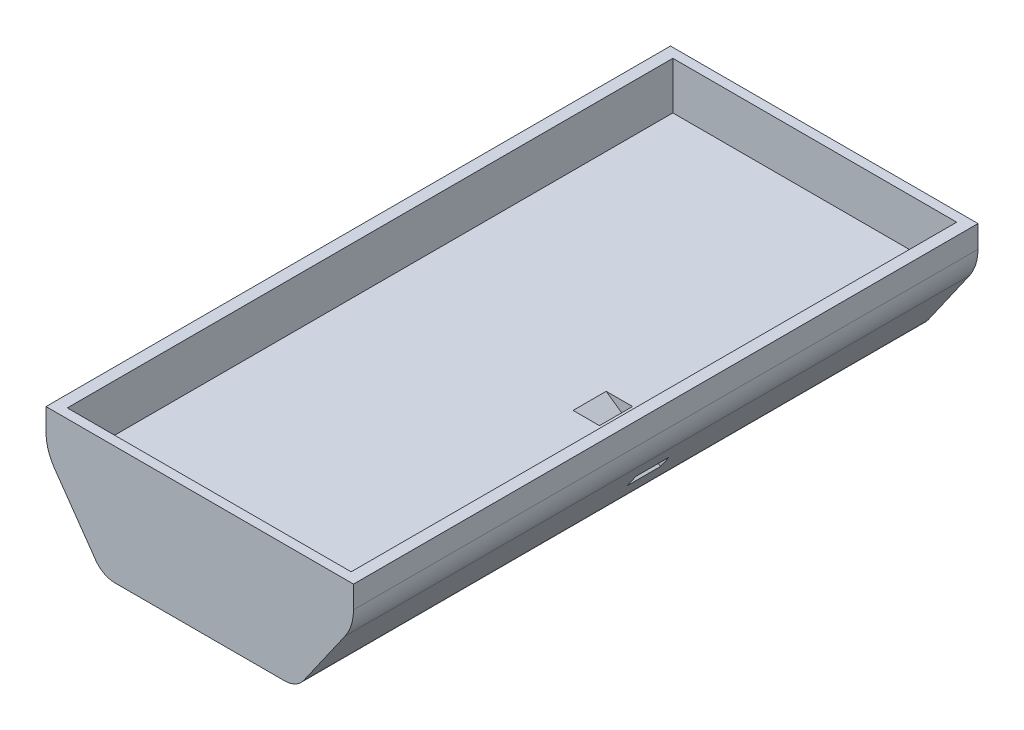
ISO-10303-21;
HEADER;
FILE_DESCRIPTION(('STEP AP214'),'2;1');
FILE_NAME('part.step','',(''),(''),'','','');
FILE_SCHEMA(('AUTOMOTIVE_DESIGN { 1 0 10303 214 1 1 1 1 }'));
ENDSEC;
DATA;
#1=APPLICATION_CONTEXT('core data for automotive mechanical design processes');
#2=APPLICATION_PROTOCOL_DEFINITION('international standard','automotive_design',2000,#1);
#3=PRODUCT_CONTEXT('',#1,'mechanical');
#4=PRODUCT('Part','Part','',(#3));
#5=PRODUCT_RELATED_PRODUCT_CATEGORY('part','',(#4));
#6=PRODUCT_DEFINITION_FORMATION('','',#4);
#7=PRODUCT_DEFINITION_CONTEXT('part definition',#1,'design');
#8=PRODUCT_DEFINITION('design','',#6,#7);
#9=PRODUCT_DEFINITION_SHAPE('','',#8);
#10=(LENGTH_UNIT() NAMED_UNIT(*) SI_UNIT(.MILLI.,.METRE.));
#11=(NAMED_UNIT(*) PLANE_ANGLE_UNIT() SI_UNIT($,.RADIAN.));
#12=(NAMED_UNIT(*) SI_UNIT($,.STERADIAN.) SOLID_ANGLE_UNIT());
#13=UNCERTAINTY_MEASURE_WITH_UNIT(LENGTH_MEASURE(1.E-05),#10,'distance_accuracy_value','');
#14=(GEOMETRIC_REPRESENTATION_CONTEXT(3) GLOBAL_UNCERTAINTY_ASSIGNED_CONTEXT((#13)) GLOBAL_UNIT_ASSIGNED_CONTEXT((#10,
#11,#12)) REPRESENTATION_CONTEXT('',''));
#15=CARTESIAN_POINT('',(0.,0.,0.));
#16=DIRECTION('',(0.,0.,1.));
#17=DIRECTION('',(1.,0.,0.));
#18=AXIS2_PLACEMENT_3D('',#15,#16,#17);
#19=CARTESIAN_POINT('',(43.3318614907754,21.0614031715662,67.));
#20=DIRECTION('',(0.,0.,1.));
#21=DIRECTION('',(1.,0.,0.));
#22=AXIS2_PLACEMENT_3D('',#19,#20,#21);
#23=PLANE('',#22);
#24=DIRECTION('',(-1.,0.,0.));
#25=VECTOR('',#24,1.);
#26=CARTESIAN_POINT('',(43.3318614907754,15.,67.));
#27=LINE('',#26,#25);
#28=CARTESIAN_POINT('',(51.9884423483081,15.,67.));
#29=VERTEX_POINT('',#28);
#30=CARTESIAN_POINT('',(46.4094126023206,15.,67.));
#31=VERTEX_POINT('',#30);
#32=EDGE_CURVE('E59',#29,#31,#27,.T.);
#33=ORIENTED_EDGE('',*,*,#32,.F.);
#34=DIRECTION('',(0.819152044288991,-0.573576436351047,0.));
#35=VECTOR('',#34,1.);
#36=CARTESIAN_POINT('',(43.3318614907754,21.0614031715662,67.));
#37=LINE('',#36,#35);
#38=CARTESIAN_POINT('',(59.7149023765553,9.58987444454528,67.));
#39=VERTEX_POINT('',#38);
#40=EDGE_CURVE('E217',#29,#39,#37,.T.);
#41=ORIENTED_EDGE('',*,*,#40,.T.);
#42=DIRECTION('',(-0.573576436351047,-0.819152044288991,0.));
#43=VECTOR('',#42,1.);
#44=CARTESIAN_POINT('',(59.7149023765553,9.58987444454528,67.));
#45=LINE('',#44,#43);
#46=CARTESIAN_POINT('',(57.8794577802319,6.96858790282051,67.));
#47=VERTEX_POINT('',#46);
#48=EDGE_CURVE('E204',#39,#47,#45,.T.);
#49=ORIENTED_EDGE('',*,*,#48,.T.);
#50=DIRECTION('',(0.819152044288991,-0.573576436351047,0.));
#51=VECTOR('',#50,1.);
#52=CARTESIAN_POINT('',(41.4964168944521,18.4401166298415,67.));
#53=LINE('',#52,#51);
#54=EDGE_CURVE('E216',#31,#47,#53,.T.);
#55=ORIENTED_EDGE('',*,*,#54,.F.);
#56=EDGE_LOOP('',(#33,#41,#49,#55));
#57=FACE_BOUND('',#56,.T.);
#58=ADVANCED_FACE('F37',(#57),#23,.F.);
#59=CARTESIAN_POINT('',(43.3318614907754,21.0614031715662,67.));
#60=DIRECTION('',(0.573576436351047,0.819152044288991,0.));
#61=DIRECTION('',(-0.819152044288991,0.573576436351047,0.));
#62=AXIS2_PLACEMENT_3D('',#59,#60,#61);
#63=PLANE('',#62);
#64=DIRECTION('',(0.,0.,1.));
#65=VECTOR('',#64,1.);
#66=CARTESIAN_POINT('',(51.9884423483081,15.,67.));
#67=LINE('',#66,#65);
#68=CARTESIAN_POINT('',(51.9884423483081,15.,60.));
#69=VERTEX_POINT('',#68);
#70=EDGE_CURVE('E201',#69,#29,#67,.T.);
#71=ORIENTED_EDGE('',*,*,#70,.F.);
#72=DIRECTION('',(0.819152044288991,-0.573576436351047,0.));
#73=VECTOR('',#72,1.);
#74=CARTESIAN_POINT('',(43.3318614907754,21.0614031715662,60.));
#75=LINE('',#74,#73);
#76=CARTESIAN_POINT('',(59.7149023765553,9.58987444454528,60.));
#77=VERTEX_POINT('',#76);
#78=EDGE_CURVE('E220',#69,#77,#75,.T.);
#79=ORIENTED_EDGE('',*,*,#78,.T.);
#80=DIRECTION('',(0.,0.,1.));
#81=VECTOR('',#80,1.);
#82=CARTESIAN_POINT('',(59.7149023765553,9.58987444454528,67.));
#83=LINE('',#82,#81);
#84=EDGE_CURVE('E213',#77,#39,#83,.T.);
#85=ORIENTED_EDGE('',*,*,#84,.T.);
#86=ORIENTED_EDGE('',*,*,#40,.F.);
#87=EDGE_LOOP('',(#71,#79,#85,#86));
#88=FACE_BOUND('',#87,.T.);
#89=ADVANCED_FACE('F361',(#88),#63,.F.);
#90=CARTESIAN_POINT('',(43.3318614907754,21.0614031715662,60.));
#91=DIRECTION('',(0.,0.,-1.));
#92=DIRECTION('',(0.,1.,0.));
#93=AXIS2_PLACEMENT_3D('',#90,#91,#92);
#94=PLANE('',#93);
#95=DIRECTION('',(1.,0.,0.));
#96=VECTOR('',#95,1.);
#97=CARTESIAN_POINT('',(43.3318614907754,15.,60.));
#98=LINE('',#97,#96);
#99=CARTESIAN_POINT('',(46.4094126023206,15.,60.));
#100=VERTEX_POINT('',#99);
#101=EDGE_CURVE('E196',#100,#69,#98,.T.);
#102=ORIENTED_EDGE('',*,*,#101,.F.);
#103=DIRECTION('',(0.819152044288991,-0.573576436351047,0.));
#104=VECTOR('',#103,1.);
#105=CARTESIAN_POINT('',(41.4964168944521,18.4401166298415,60.));
#106=LINE('',#105,#104);
#107=CARTESIAN_POINT('',(57.8794577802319,6.96858790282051,60.));
#108=VERTEX_POINT('',#107);
#109=EDGE_CURVE('E222',#100,#108,#106,.T.);
#110=ORIENTED_EDGE('',*,*,#109,.T.);
#111=DIRECTION('',(0.573576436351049,0.81915204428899,0.));
#112=VECTOR('',#111,1.);
#113=CARTESIAN_POINT('',(59.7149023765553,9.58987444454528,60.));
#114=LINE('',#113,#112);
#115=EDGE_CURVE('E210',#108,#77,#114,.T.);
#116=ORIENTED_EDGE('',*,*,#115,.T.);
#117=ORIENTED_EDGE('',*,*,#78,.F.);
#118=EDGE_LOOP('',(#102,#110,#116,#117));
#119=FACE_BOUND('',#118,.T.);
#120=ADVANCED_FACE('F368',(#119),#94,.F.);
#121=CARTESIAN_POINT('',(41.4964168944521,18.4401166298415,67.));
#122=DIRECTION('',(-0.573576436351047,-0.819152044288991,0.));
#123=DIRECTION('',(0.819152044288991,-0.573576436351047,0.));
#124=AXIS2_PLACEMENT_3D('',#121,#122,#123);
#125=PLANE('',#124);
#126=DIRECTION('',(0.,0.,-1.));
#127=VECTOR('',#126,1.);
#128=CARTESIAN_POINT('',(46.4094126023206,15.,67.));
#129=LINE('',#128,#127);
#130=EDGE_CURVE('E11',#31,#100,#129,.T.);
#131=ORIENTED_EDGE('',*,*,#130,.F.);
#132=ORIENTED_EDGE('',*,*,#54,.T.);
#133=DIRECTION('',(0.,0.,-1.));
#134=VECTOR('',#133,1.);
#135=CARTESIAN_POINT('',(57.8794577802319,6.96858790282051,67.));
#136=LINE('',#135,#134);
#137=EDGE_CURVE('E207',#47,#108,#136,.T.);
#138=ORIENTED_EDGE('',*,*,#137,.T.);
#139=ORIENTED_EDGE('',*,*,#109,.F.);
#140=EDGE_LOOP('',(#131,#132,#138,#139));
#141=FACE_BOUND('',#140,.T.);
#142=ADVANCED_FACE('F373',(#141),#125,.F.);
#143=CARTESIAN_POINT('',(0.,0.,132.));
#144=DIRECTION('',(0.,0.,-1.));
#145=DIRECTION('',(-1.,0.,0.));
#146=AXIS2_PLACEMENT_3D('',#143,#144,#145);
#147=PLANE('',#146);
#148=DIRECTION('',(1.,0.,0.));
#149=VECTOR('',#148,1.);
#150=CARTESIAN_POINT('',(0.,25.,132.));
#151=LINE('',#150,#149);
#152=CARTESIAN_POINT('',(0.,25.,132.));
#153=VERTEX_POINT('',#152);
#154=CARTESIAN_POINT('',(65.,25.,132.));
#155=VERTEX_POINT('',#154);
#156=EDGE_CURVE('E230',#153,#155,#151,.T.);
#157=ORIENTED_EDGE('',*,*,#156,.F.);
#158=DIRECTION('',(0.,-1.,0.));
#159=VECTOR('',#158,1.);
#160=CARTESIAN_POINT('',(0.,0.,132.));
#161=LINE('',#160,#159);
#162=CARTESIAN_POINT('',(0.,20.2907639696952,132.));
#163=VERTEX_POINT('',#162);
#164=EDGE_CURVE('E235',#153,#163,#161,.T.);
#165=ORIENTED_EDGE('',*,*,#164,.T.);
#166=CARTESIAN_POINT('',(9.99999999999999,20.2907639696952,132.));
#167=DIRECTION('',(0.,0.,-1.));
#168=DIRECTION('',(-1.,0.,0.));
#169=AXIS2_PLACEMENT_3D('',#166,#167,#168);
#170=CIRCLE('',#169,10.);
#171=CARTESIAN_POINT('',(1.80847955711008,14.5549996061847,132.));
#172=VERTEX_POINT('',#171);
#173=EDGE_CURVE('E273',#163,#172,#170,.F.);
#174=ORIENTED_EDGE('',*,*,#173,.T.);
#175=DIRECTION('',(-0.573576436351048,0.819152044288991,0.));
#176=VECTOR('',#175,1.);
#177=CARTESIAN_POINT('',(12.,0.,132.));
#178=LINE('',#177,#176);
#179=CARTESIAN_POINT('',(10.5070750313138,2.13211781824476,132.));
#180=VERTEX_POINT('',#179);
#181=EDGE_CURVE('E267',#172,#180,#178,.F.);
#182=ORIENTED_EDGE('',*,*,#181,.T.);
#183=CARTESIAN_POINT('',(14.6028352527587,5.,132.));
#184=DIRECTION('',(0.,0.,-1.));
#185=DIRECTION('',(-1.,0.,0.));
#186=AXIS2_PLACEMENT_3D('',#183,#184,#185);
#187=CIRCLE('',#186,5.);
#188=CARTESIAN_POINT('',(14.6028352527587,0.,132.));
#189=VERTEX_POINT('',#188);
#190=EDGE_CURVE('E301',#180,#189,#187,.F.);
#191=ORIENTED_EDGE('',*,*,#190,.T.);
#192=DIRECTION('',(1.,0.,0.));
#193=VECTOR('',#192,1.);
#194=CARTESIAN_POINT('',(0.,0.,132.));
#195=LINE('',#194,#193);
#196=CARTESIAN_POINT('',(50.3971647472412,0.,132.));
#197=VERTEX_POINT('',#196);
#198=EDGE_CURVE('E237',#189,#197,#195,.T.);
#199=ORIENTED_EDGE('',*,*,#198,.T.);
#200=CARTESIAN_POINT('',(50.3971647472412,5.,132.));
#201=DIRECTION('',(0.,0.,-1.));
#202=DIRECTION('',(-1.,0.,0.));
#203=AXIS2_PLACEMENT_3D('',#200,#201,#202);
#204=CIRCLE('',#203,5.);
#205=CARTESIAN_POINT('',(54.4929249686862,2.13211781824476,132.));
#206=VERTEX_POINT('',#205);
#207=EDGE_CURVE('E299',#197,#206,#204,.F.);
#208=ORIENTED_EDGE('',*,*,#207,.T.);
#209=DIRECTION('',(-0.573576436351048,-0.819152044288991,0.));
#210=VECTOR('',#209,1.);
#211=CARTESIAN_POINT('',(65.,17.1377760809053,132.));
#212=LINE('',#211,#210);
#213=CARTESIAN_POINT('',(63.1915204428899,14.5549996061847,132.));
#214=VERTEX_POINT('',#213);
#215=EDGE_CURVE('E253',#206,#214,#212,.F.);
#216=ORIENTED_EDGE('',*,*,#215,.T.);
#217=CARTESIAN_POINT('',(55.,20.2907639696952,132.));
#218=DIRECTION('',(0.,0.,-1.));
#219=DIRECTION('',(-1.,0.,0.));
#220=AXIS2_PLACEMENT_3D('',#217,#218,#219);
#221=CIRCLE('',#220,10.);
#222=CARTESIAN_POINT('',(65.,20.2907639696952,132.));
#223=VERTEX_POINT('',#222);
#224=EDGE_CURVE('E263',#214,#223,#221,.F.);
#225=ORIENTED_EDGE('',*,*,#224,.T.);
#226=DIRECTION('',(0.,1.,0.));
#227=VECTOR('',#226,1.);
#228=CARTESIAN_POINT('',(65.,0.,132.));
#229=LINE('',#228,#227);
#230=EDGE_CURVE('E241',#223,#155,#229,.T.);
#231=ORIENTED_EDGE('',*,*,#230,.T.);
#232=EDGE_LOOP('',(#157,#165,#174,#182,#191,#199,#208,#216,#225,#231));
#233=FACE_BOUND('',#232,.T.);
#234=ADVANCED_FACE('F323',(#233),#147,.F.);
#235=CARTESIAN_POINT('',(0.,0.,0.));
#236=DIRECTION('',(0.,0.,-1.));
#237=DIRECTION('',(-1.,0.,0.));
#238=AXIS2_PLACEMENT_3D('',#235,#236,#237);
#239=PLANE('',#238);
#240=CARTESIAN_POINT('',(32.5,13.,0.));
#241=DIRECTION('',(0.,0.,-1.));
#242=DIRECTION('',(-1.,0.,0.));
#243=AXIS2_PLACEMENT_3D('',#240,#241,#242);
#244=CIRCLE('',#243,2.5);
#245=CARTESIAN_POINT('',(30.,13.,0.));
#246=VERTEX_POINT('',#245);
#247=EDGE_CURVE('E219',#246,#246,#244,.T.);
#248=ORIENTED_EDGE('',*,*,#247,.F.);
#249=EDGE_LOOP('',(#248));
#250=FACE_BOUND('',#249,.T.);
#251=CARTESIAN_POINT('',(32.5,19.,0.));
#252=DIRECTION('',(0.,0.,-1.));
#253=DIRECTION('',(-1.,0.,0.));
#254=AXIS2_PLACEMENT_3D('',#251,#252,#253);
#255=CIRCLE('',#254,2.5);
#256=CARTESIAN_POINT('',(30.,19.,0.));
#257=VERTEX_POINT('',#256);
#258=EDGE_CURVE('E227',#257,#257,#255,.T.);
#259=ORIENTED_EDGE('',*,*,#258,.F.);
#260=EDGE_LOOP('',(#259));
#261=FACE_BOUND('',#260,.T.);
#262=DIRECTION('',(0.,-1.,0.));
#263=VECTOR('',#262,1.);
#264=CARTESIAN_POINT('',(0.,0.,0.));
#265=LINE('',#264,#263);
#266=CARTESIAN_POINT('',(0.,25.,0.));
#267=VERTEX_POINT('',#266);
#268=CARTESIAN_POINT('',(0.,20.2907639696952,0.));
#269=VERTEX_POINT('',#268);
#270=EDGE_CURVE('E234',#267,#269,#265,.T.);
#271=ORIENTED_EDGE('',*,*,#270,.F.);
#272=DIRECTION('',(-1.,0.,0.));
#273=VECTOR('',#272,1.);
#274=CARTESIAN_POINT('',(0.,25.,0.));
#275=LINE('',#274,#273);
#276=CARTESIAN_POINT('',(65.,25.,0.));
#277=VERTEX_POINT('',#276);
#278=EDGE_CURVE('E232',#277,#267,#275,.T.);
#279=ORIENTED_EDGE('',*,*,#278,.F.);
#280=DIRECTION('',(0.,1.,0.));
#281=VECTOR('',#280,1.);
#282=CARTESIAN_POINT('',(65.,0.,0.));
#283=LINE('',#282,#281);
#284=CARTESIAN_POINT('',(65.,20.2907639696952,0.));
#285=VERTEX_POINT('',#284);
#286=EDGE_CURVE('E238',#285,#277,#283,.T.);
#287=ORIENTED_EDGE('',*,*,#286,.F.);
#288=CARTESIAN_POINT('',(55.,20.2907639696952,0.));
#289=DIRECTION('',(0.,0.,-1.));
#290=DIRECTION('',(-1.,0.,0.));
#291=AXIS2_PLACEMENT_3D('',#288,#289,#290);
#292=CIRCLE('',#291,10.);
#293=CARTESIAN_POINT('',(63.1915204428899,14.5549996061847,0.));
#294=VERTEX_POINT('',#293);
#295=EDGE_CURVE('E258',#285,#294,#292,.T.);
#296=ORIENTED_EDGE('',*,*,#295,.T.);
#297=DIRECTION('',(0.573576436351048,0.819152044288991,0.));
#298=VECTOR('',#297,1.);
#299=CARTESIAN_POINT('',(35.5635337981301,-24.9018544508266,0.));
#300=LINE('',#299,#298);
#301=CARTESIAN_POINT('',(54.4929249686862,2.13211781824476,0.));
#302=VERTEX_POINT('',#301);
#303=EDGE_CURVE('E244',#294,#302,#300,.F.);
#304=ORIENTED_EDGE('',*,*,#303,.T.);
#305=CARTESIAN_POINT('',(50.3971647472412,5.,0.));
#306=DIRECTION('',(0.,0.,-1.));
#307=DIRECTION('',(-1.,0.,0.));
#308=AXIS2_PLACEMENT_3D('',#305,#306,#307);
#309=CIRCLE('',#308,5.);
#310=CARTESIAN_POINT('',(50.3971647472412,0.,0.));
#311=VERTEX_POINT('',#310);
#312=EDGE_CURVE('E293',#302,#311,#309,.T.);
#313=ORIENTED_EDGE('',*,*,#312,.T.);
#314=DIRECTION('',(1.,0.,0.));
#315=VECTOR('',#314,1.);
#316=CARTESIAN_POINT('',(0.,0.,0.));
#317=LINE('',#316,#315);
#318=CARTESIAN_POINT('',(14.6028352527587,0.,0.));
#319=VERTEX_POINT('',#318);
#320=EDGE_CURVE('E246',#319,#311,#317,.T.);
#321=ORIENTED_EDGE('',*,*,#320,.F.);
#322=CARTESIAN_POINT('',(14.6028352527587,5.,0.));
#323=DIRECTION('',(0.,0.,-1.));
#324=DIRECTION('',(-1.,0.,0.));
#325=AXIS2_PLACEMENT_3D('',#322,#323,#324);
#326=CIRCLE('',#325,5.);
#327=CARTESIAN_POINT('',(10.5070750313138,2.13211781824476,0.));
#328=VERTEX_POINT('',#327);
#329=EDGE_CURVE('E295',#319,#328,#326,.T.);
#330=ORIENTED_EDGE('',*,*,#329,.T.);
#331=DIRECTION('',(0.573576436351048,-0.819152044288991,0.));
#332=VECTOR('',#331,1.);
#333=CARTESIAN_POINT('',(8.052120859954,5.63815572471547,0.));
#334=LINE('',#333,#332);
#335=CARTESIAN_POINT('',(1.80847955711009,14.5549996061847,0.));
#336=VERTEX_POINT('',#335);
#337=EDGE_CURVE('E265',#328,#336,#334,.F.);
#338=ORIENTED_EDGE('',*,*,#337,.T.);
#339=CARTESIAN_POINT('',(9.99999999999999,20.2907639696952,0.));
#340=DIRECTION('',(0.,0.,-1.));
#341=DIRECTION('',(-1.,0.,0.));
#342=AXIS2_PLACEMENT_3D('',#339,#340,#341);
#343=CIRCLE('',#342,10.);
#344=EDGE_CURVE('E278',#336,#269,#343,.T.);
#345=ORIENTED_EDGE('',*,*,#344,.T.);
#346=EDGE_LOOP('',(#271,#279,#287,#296,#304,#313,#321,#330,#338,#345));
#347=FACE_BOUND('',#346,.T.);
#348=ADVANCED_FACE('F312',(#250,#261,#347),#239,.T.);
#349=CARTESIAN_POINT('',(0.,0.,132.));
#350=DIRECTION('',(1.,0.,0.));
#351=DIRECTION('',(0.,1.,0.));
#352=AXIS2_PLACEMENT_3D('',#349,#350,#351);
#353=PLANE('',#352);
#354=ORIENTED_EDGE('',*,*,#164,.F.);
#355=DIRECTION('',(0.,0.,-1.));
#356=VECTOR('',#355,1.);
#357=CARTESIAN_POINT('',(0.,25.,132.));
#358=LINE('',#357,#356);
#359=EDGE_CURVE('E284',#153,#267,#358,.T.);
#360=ORIENTED_EDGE('',*,*,#359,.T.);
#361=ORIENTED_EDGE('',*,*,#270,.T.);
#362=DIRECTION('',(0.,0.,-1.));
#363=VECTOR('',#362,1.);
#364=CARTESIAN_POINT('',(0.,20.2907639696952,132.));
#365=LINE('',#364,#363);
#366=EDGE_CURVE('E270',#269,#163,#365,.F.);
#367=ORIENTED_EDGE('',*,*,#366,.T.);
#368=EDGE_LOOP('',(#354,#360,#361,#367));
#369=FACE_BOUND('',#368,.T.);
#370=ADVANCED_FACE('F341',(#369),#353,.F.);
#371=CARTESIAN_POINT('',(0.,0.,132.));
#372=DIRECTION('',(0.,1.,0.));
#373=DIRECTION('',(0.,0.,1.));
#374=AXIS2_PLACEMENT_3D('',#371,#372,#373);
#375=PLANE('',#374);
#376=ORIENTED_EDGE('',*,*,#198,.F.);
#377=DIRECTION('',(0.,0.,1.));
#378=VECTOR('',#377,1.);
#379=CARTESIAN_POINT('',(14.6028352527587,0.,0.));
#380=LINE('',#379,#378);
#381=EDGE_CURVE('E290',#189,#319,#380,.F.);
#382=ORIENTED_EDGE('',*,*,#381,.T.);
#383=ORIENTED_EDGE('',*,*,#320,.T.);
#384=DIRECTION('',(0.,0.,-1.));
#385=VECTOR('',#384,1.);
#386=CARTESIAN_POINT('',(50.3971647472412,0.,132.));
#387=LINE('',#386,#385);
#388=EDGE_CURVE('E287',#311,#197,#387,.F.);
#389=ORIENTED_EDGE('',*,*,#388,.T.);
#390=EDGE_LOOP('',(#376,#382,#383,#389));
#391=FACE_BOUND('',#390,.T.);
#392=ADVANCED_FACE('F319',(#391),#375,.F.);
#393=CARTESIAN_POINT('',(65.,0.,132.));
#394=DIRECTION('',(-1.,0.,0.));
#395=DIRECTION('',(0.,0.,1.));
#396=AXIS2_PLACEMENT_3D('',#393,#394,#395);
#397=PLANE('',#396);
#398=ORIENTED_EDGE('',*,*,#286,.T.);
#399=DIRECTION('',(0.,0.,-1.));
#400=VECTOR('',#399,1.);
#401=CARTESIAN_POINT('',(65.,25.,132.));
#402=LINE('',#401,#400);
#403=EDGE_CURVE('E281',#277,#155,#402,.F.);
#404=ORIENTED_EDGE('',*,*,#403,.T.);
#405=ORIENTED_EDGE('',*,*,#230,.F.);
#406=DIRECTION('',(0.,0.,1.));
#407=VECTOR('',#406,1.);
#408=CARTESIAN_POINT('',(65.,20.2907639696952,0.));
#409=LINE('',#408,#407);
#410=EDGE_CURVE('E255',#223,#285,#409,.F.);
#411=ORIENTED_EDGE('',*,*,#410,.T.);
#412=EDGE_LOOP('',(#398,#404,#405,#411));
#413=FACE_BOUND('',#412,.T.);
#414=ADVANCED_FACE('F348',(#413),#397,.F.);
#415=CARTESIAN_POINT('',(65.,17.1377760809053,132.));
#416=DIRECTION('',(-0.819152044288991,0.573576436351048,0.));
#417=DIRECTION('',(0.,0.,-1.));
#418=AXIS2_PLACEMENT_3D('',#415,#416,#417);
#419=PLANE('',#418);
#420=ORIENTED_EDGE('',*,*,#48,.F.);
#421=ORIENTED_EDGE('',*,*,#84,.F.);
#422=ORIENTED_EDGE('',*,*,#115,.F.);
#423=ORIENTED_EDGE('',*,*,#137,.F.);
#424=EDGE_LOOP('',(#420,#421,#422,#423));
#425=FACE_BOUND('',#424,.T.);
#426=ORIENTED_EDGE('',*,*,#215,.F.);
#427=DIRECTION('',(0.,0.,1.));
#428=VECTOR('',#427,1.);
#429=CARTESIAN_POINT('',(54.4929249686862,2.13211781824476,0.));
#430=LINE('',#429,#428);
#431=EDGE_CURVE('E45',#206,#302,#430,.F.);
#432=ORIENTED_EDGE('',*,*,#431,.T.);
#433=ORIENTED_EDGE('',*,*,#303,.F.);
#434=DIRECTION('',(0.,0.,-1.));
#435=VECTOR('',#434,1.);
#436=CARTESIAN_POINT('',(63.1915204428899,14.5549996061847,132.));
#437=LINE('',#436,#435);
#438=EDGE_CURVE('E260',#294,#214,#437,.F.);
#439=ORIENTED_EDGE('',*,*,#438,.T.);
#440=EDGE_LOOP('',(#426,#432,#433,#439));
#441=FACE_BOUND('',#440,.T.);
#442=ADVANCED_FACE('F306',(#425,#441),#419,.F.);
#443=CARTESIAN_POINT('',(55.,20.2907639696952,132.));
#444=DIRECTION('',(0.,0.,-1.));
#445=DIRECTION('',(-1.,0.,0.));
#446=AXIS2_PLACEMENT_3D('',#443,#444,#445);
#447=CYLINDRICAL_SURFACE('',#446,10.);
#448=ORIENTED_EDGE('',*,*,#224,.F.);
#449=ORIENTED_EDGE('',*,*,#438,.F.);
#450=ORIENTED_EDGE('',*,*,#295,.F.);
#451=ORIENTED_EDGE('',*,*,#410,.F.);
#452=EDGE_LOOP('',(#448,#449,#450,#451));
#453=FACE_BOUND('',#452,.T.);
#454=ADVANCED_FACE('F350',(#453),#447,.T.);
#455=CARTESIAN_POINT('',(12.,0.,132.));
#456=DIRECTION('',(0.819152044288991,0.573576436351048,0.));
#457=DIRECTION('',(0.,0.,-1.));
#458=AXIS2_PLACEMENT_3D('',#455,#456,#457);
#459=PLANE('',#458);
#460=ORIENTED_EDGE('',*,*,#337,.F.);
#461=DIRECTION('',(0.,0.,-1.));
#462=VECTOR('',#461,1.);
#463=CARTESIAN_POINT('',(10.5070750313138,2.13211781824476,132.));
#464=LINE('',#463,#462);
#465=EDGE_CURVE('E297',#328,#180,#464,.F.);
#466=ORIENTED_EDGE('',*,*,#465,.T.);
#467=ORIENTED_EDGE('',*,*,#181,.F.);
#468=DIRECTION('',(0.,0.,1.));
#469=VECTOR('',#468,1.);
#470=CARTESIAN_POINT('',(1.80847955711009,14.5549996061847,0.));
#471=LINE('',#470,#469);
#472=EDGE_CURVE('E275',#172,#336,#471,.F.);
#473=ORIENTED_EDGE('',*,*,#472,.T.);
#474=EDGE_LOOP('',(#460,#466,#467,#473));
#475=FACE_BOUND('',#474,.T.);
#476=ADVANCED_FACE('F331',(#475),#459,.F.);
#477=CARTESIAN_POINT('',(9.99999999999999,20.2907639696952,132.));
#478=DIRECTION('',(0.,0.,1.));
#479=DIRECTION('',(1.,0.,0.));
#480=AXIS2_PLACEMENT_3D('',#477,#478,#479);
#481=CYLINDRICAL_SURFACE('',#480,10.);
#482=ORIENTED_EDGE('',*,*,#344,.F.);
#483=ORIENTED_EDGE('',*,*,#472,.F.);
#484=ORIENTED_EDGE('',*,*,#173,.F.);
#485=ORIENTED_EDGE('',*,*,#366,.F.);
#486=EDGE_LOOP('',(#482,#483,#484,#485));
#487=FACE_BOUND('',#486,.T.);
#488=ADVANCED_FACE('F337',(#487),#481,.T.);
#489=CARTESIAN_POINT('',(14.6028352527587,5.,132.));
#490=DIRECTION('',(0.,0.,-1.));
#491=DIRECTION('',(-1.,0.,0.));
#492=AXIS2_PLACEMENT_3D('',#489,#490,#491);
#493=CYLINDRICAL_SURFACE('',#492,5.);
#494=ORIENTED_EDGE('',*,*,#190,.F.);
#495=ORIENTED_EDGE('',*,*,#465,.F.);
#496=ORIENTED_EDGE('',*,*,#329,.F.);
#497=ORIENTED_EDGE('',*,*,#381,.F.);
#498=EDGE_LOOP('',(#494,#495,#496,#497));
#499=FACE_BOUND('',#498,.T.);
#500=ADVANCED_FACE('F328',(#499),#493,.T.);
#501=CARTESIAN_POINT('',(50.3971647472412,5.,132.));
#502=DIRECTION('',(0.,0.,1.));
#503=DIRECTION('',(1.,0.,0.));
#504=AXIS2_PLACEMENT_3D('',#501,#502,#503);
#505=CYLINDRICAL_SURFACE('',#504,5.);
#506=ORIENTED_EDGE('',*,*,#312,.F.);
#507=ORIENTED_EDGE('',*,*,#431,.F.);
#508=ORIENTED_EDGE('',*,*,#207,.F.);
#509=ORIENTED_EDGE('',*,*,#388,.F.);
#510=EDGE_LOOP('',(#506,#507,#508,#509));
#511=FACE_BOUND('',#510,.T.);
#512=ADVANCED_FACE('F316',(#511),#505,.T.);
#513=CARTESIAN_POINT('',(0.,25.,0.));
#514=DIRECTION('',(0.,1.,0.));
#515=DIRECTION('',(0.,0.,1.));
#516=AXIS2_PLACEMENT_3D('',#513,#514,#515);
#517=PLANE('',#516);
#518=DIRECTION('',(0.,0.,1.));
#519=VECTOR('',#518,1.);
#520=CARTESIAN_POINT('',(2.49999999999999,25.,2.));
#521=LINE('',#520,#519);
#522=CARTESIAN_POINT('',(2.49999999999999,25.,2.));
#523=VERTEX_POINT('',#522);
#524=CARTESIAN_POINT('',(2.5,25.,130.));
#525=VERTEX_POINT('',#524);
#526=EDGE_CURVE('E52',#523,#525,#521,.T.);
#527=ORIENTED_EDGE('',*,*,#526,.F.);
#528=DIRECTION('',(-1.,0.,0.));
#529=VECTOR('',#528,1.);
#530=CARTESIAN_POINT('',(2.49999999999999,25.,2.));
#531=LINE('',#530,#529);
#532=CARTESIAN_POINT('',(62.5,25.,2.));
#533=VERTEX_POINT('',#532);
#534=EDGE_CURVE('E181',#533,#523,#531,.T.);
#535=ORIENTED_EDGE('',*,*,#534,.F.);
#536=DIRECTION('',(0.,0.,-1.));
#537=VECTOR('',#536,1.);
#538=CARTESIAN_POINT('',(62.5,25.,2.));
#539=LINE('',#538,#537);
#540=CARTESIAN_POINT('',(62.5,25.,130.));
#541=VERTEX_POINT('',#540);
#542=EDGE_CURVE('E184',#541,#533,#539,.T.);
#543=ORIENTED_EDGE('',*,*,#542,.F.);
#544=DIRECTION('',(1.,0.,0.));
#545=VECTOR('',#544,1.);
#546=CARTESIAN_POINT('',(2.5,25.,130.));
#547=LINE('',#546,#545);
#548=EDGE_CURVE('E190',#525,#541,#547,.T.);
#549=ORIENTED_EDGE('',*,*,#548,.F.);
#550=EDGE_LOOP('',(#527,#535,#543,#549));
#551=FACE_BOUND('',#550,.T.);
#552=ORIENTED_EDGE('',*,*,#359,.F.);
#553=ORIENTED_EDGE('',*,*,#156,.T.);
#554=ORIENTED_EDGE('',*,*,#403,.F.);
#555=ORIENTED_EDGE('',*,*,#278,.T.);
#556=EDGE_LOOP('',(#552,#553,#554,#555));
#557=FACE_BOUND('',#556,.T.);
#558=ADVANCED_FACE('F343',(#551,#557),#517,.T.);
#559=CARTESIAN_POINT('',(32.5,19.,0.));
#560=DIRECTION('',(0.,0.,-1.));
#561=DIRECTION('',(-1.,0.,0.));
#562=AXIS2_PLACEMENT_3D('',#559,#560,#561);
#563=SPHERICAL_SURFACE('',#562,2.5);
#564=ORIENTED_EDGE('',*,*,#258,.T.);
#565=EDGE_LOOP('',(#564));
#566=FACE_BOUND('',#565,.T.);
#567=ADVANCED_FACE('F377',(#566),#563,.T.);
#568=CARTESIAN_POINT('',(32.5,13.,0.));
#569=DIRECTION('',(0.,0.,-1.));
#570=DIRECTION('',(-1.,0.,0.));
#571=AXIS2_PLACEMENT_3D('',#568,#569,#570);
#572=SPHERICAL_SURFACE('',#571,2.5);
#573=ORIENTED_EDGE('',*,*,#247,.T.);
#574=EDGE_LOOP('',(#573));
#575=FACE_BOUND('',#574,.T.);
#576=ADVANCED_FACE('F39',(#575),#572,.T.);
#577=CARTESIAN_POINT('',(0.,15.,0.));
#578=DIRECTION('',(0.,1.,0.));
#579=DIRECTION('',(0.,0.,1.));
#580=AXIS2_PLACEMENT_3D('',#577,#578,#579);
#581=PLANE('',#580);
#582=DIRECTION('',(0.,0.,1.));
#583=VECTOR('',#582,1.);
#584=CARTESIAN_POINT('',(2.49999999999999,15.,2.));
#585=LINE('',#584,#583);
#586=CARTESIAN_POINT('',(2.49999999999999,15.,2.));
#587=VERTEX_POINT('',#586);
#588=CARTESIAN_POINT('',(2.5,15.,130.));
#589=VERTEX_POINT('',#588);
#590=EDGE_CURVE('E163',#587,#589,#585,.T.);
#591=ORIENTED_EDGE('',*,*,#590,.T.);
#592=DIRECTION('',(1.,0.,0.));
#593=VECTOR('',#592,1.);
#594=CARTESIAN_POINT('',(2.5,15.,130.));
#595=LINE('',#594,#593);
#596=CARTESIAN_POINT('',(62.5,15.,130.));
#597=VERTEX_POINT('',#596);
#598=EDGE_CURVE('E172',#589,#597,#595,.T.);
#599=ORIENTED_EDGE('',*,*,#598,.T.);
#600=DIRECTION('',(0.,0.,-1.));
#601=VECTOR('',#600,1.);
#602=CARTESIAN_POINT('',(62.5,15.,2.));
#603=LINE('',#602,#601);
#604=CARTESIAN_POINT('',(62.5,15.,2.));
#605=VERTEX_POINT('',#604);
#606=EDGE_CURVE('E177',#597,#605,#603,.T.);
#607=ORIENTED_EDGE('',*,*,#606,.T.);
#608=DIRECTION('',(-1.,0.,0.));
#609=VECTOR('',#608,1.);
#610=CARTESIAN_POINT('',(2.49999999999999,15.,2.));
#611=LINE('',#610,#609);
#612=EDGE_CURVE('E169',#605,#587,#611,.T.);
#613=ORIENTED_EDGE('',*,*,#612,.T.);
#614=EDGE_LOOP('',(#591,#599,#607,#613));
#615=FACE_BOUND('',#614,.T.);
#616=ORIENTED_EDGE('',*,*,#32,.T.);
#617=ORIENTED_EDGE('',*,*,#130,.T.);
#618=ORIENTED_EDGE('',*,*,#101,.T.);
#619=ORIENTED_EDGE('',*,*,#70,.T.);
#620=EDGE_LOOP('',(#616,#617,#618,#619));
#621=FACE_BOUND('',#620,.T.);
#622=ADVANCED_FACE('F179',(#615,#621),#581,.T.);
#623=CARTESIAN_POINT('',(2.49999999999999,15.,2.));
#624=DIRECTION('',(-1.,0.,0.));
#625=DIRECTION('',(0.,0.,1.));
#626=AXIS2_PLACEMENT_3D('',#623,#624,#625);
#627=PLANE('',#626);
#628=ORIENTED_EDGE('',*,*,#526,.T.);
#629=DIRECTION('',(0.,1.,0.));
#630=VECTOR('',#629,1.);
#631=CARTESIAN_POINT('',(2.5,15.,130.));
#632=LINE('',#631,#630);
#633=EDGE_CURVE('E159',#589,#525,#632,.T.);
#634=ORIENTED_EDGE('',*,*,#633,.F.);
#635=ORIENTED_EDGE('',*,*,#590,.F.);
#636=DIRECTION('',(0.,1.,0.));
#637=VECTOR('',#636,1.);
#638=CARTESIAN_POINT('',(2.49999999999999,15.,2.));
#639=LINE('',#638,#637);
#640=EDGE_CURVE('E194',#587,#523,#639,.T.);
#641=ORIENTED_EDGE('',*,*,#640,.T.);
#642=EDGE_LOOP('',(#628,#634,#635,#641));
#643=FACE_BOUND('',#642,.T.);
#644=ADVANCED_FACE('F161',(#643),#627,.F.);
#645=CARTESIAN_POINT('',(2.49999999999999,15.,2.));
#646=DIRECTION('',(0.,0.,-1.));
#647=DIRECTION('',(-1.,0.,0.));
#648=AXIS2_PLACEMENT_3D('',#645,#646,#647);
#649=PLANE('',#648);
#650=ORIENTED_EDGE('',*,*,#534,.T.);
#651=ORIENTED_EDGE('',*,*,#640,.F.);
#652=ORIENTED_EDGE('',*,*,#612,.F.);
#653=DIRECTION('',(0.,1.,0.));
#654=VECTOR('',#653,1.);
#655=CARTESIAN_POINT('',(62.5,15.,2.));
#656=LINE('',#655,#654);
#657=EDGE_CURVE('E197',#605,#533,#656,.T.);
#658=ORIENTED_EDGE('',*,*,#657,.T.);
#659=EDGE_LOOP('',(#650,#651,#652,#658));
#660=FACE_BOUND('',#659,.T.);
#661=ADVANCED_FACE('F493',(#660),#649,.F.);
#662=CARTESIAN_POINT('',(62.5,15.,2.));
#663=DIRECTION('',(1.,0.,0.));
#664=DIRECTION('',(0.,0.,-1.));
#665=AXIS2_PLACEMENT_3D('',#662,#663,#664);
#666=PLANE('',#665);
#667=ORIENTED_EDGE('',*,*,#542,.T.);
#668=ORIENTED_EDGE('',*,*,#657,.F.);
#669=ORIENTED_EDGE('',*,*,#606,.F.);
#670=DIRECTION('',(0.,1.,0.));
#671=VECTOR('',#670,1.);
#672=CARTESIAN_POINT('',(62.5,15.,130.));
#673=LINE('',#672,#671);
#674=EDGE_CURVE('E168',#597,#541,#673,.T.);
#675=ORIENTED_EDGE('',*,*,#674,.T.);
#676=EDGE_LOOP('',(#667,#668,#669,#675));
#677=FACE_BOUND('',#676,.T.);
#678=ADVANCED_FACE('F502',(#677),#666,.F.);
#679=CARTESIAN_POINT('',(2.5,15.,130.));
#680=DIRECTION('',(0.,0.,1.));
#681=DIRECTION('',(1.,0.,0.));
#682=AXIS2_PLACEMENT_3D('',#679,#680,#681);
#683=PLANE('',#682);
#684=ORIENTED_EDGE('',*,*,#548,.T.);
#685=ORIENTED_EDGE('',*,*,#674,.F.);
#686=ORIENTED_EDGE('',*,*,#598,.F.);
#687=ORIENTED_EDGE('',*,*,#633,.T.);
#688=EDGE_LOOP('',(#684,#685,#686,#687));
#689=FACE_BOUND('',#688,.T.);
#690=ADVANCED_FACE('F173',(#689),#683,.F.);
#691=CLOSED_SHELL('',(#58,#89,#120,#142,#234,#348,#370,#392,#414,#442,#454,#476,#488,#500,#512,
#558,#567,#576,#622,#644,#661,#678,#690));
#692=MANIFOLD_SOLID_BREP('B2',#691);
#693=ADVANCED_BREP_SHAPE_REPRESENTATION('',(#18,#692),#14);
#694=SHAPE_DEFINITION_REPRESENTATION(#9,#693);
ENDSEC;
END-ISO-10303-21;
